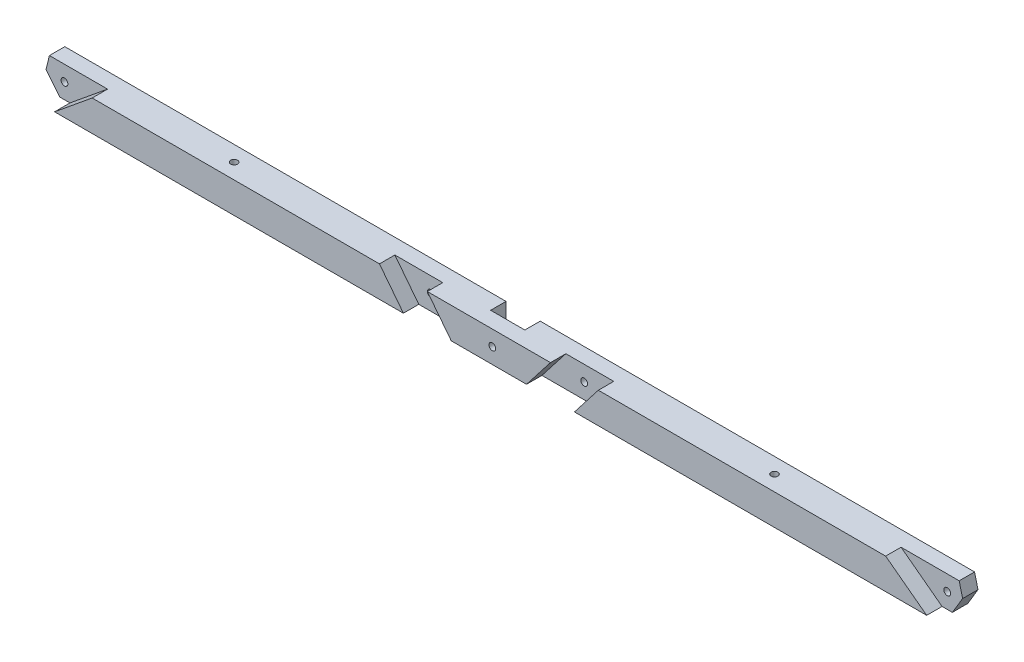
from build123d import *

# Parameters (mm, degrees)
ESQUISSE1_W              = 268
ESQUISSE1_H              = 9
EXTRUSION1_DEPTH         = 9
ESQUISSE2_W              = 10
ESQUISSE2_H              = 9
ENL_V_MAT_EXTRU_1_DEPTH  = 4.5
ESQUISSE3_R              = 1
ENL_V_MAT_EXTRU_2_DEPTH  = 4.5
ENL_V_MAT_EXTRU_3_DEPTH  = 4.5
ESQUISSE5_R              = 1
ENL_V_MAT_EXTRU_4_DEPTH  = 4.5
ENL_V_MAT_EXTRU_5_DEPTH  = 4.5
ESQUISSE7_R              = 1
ENL_V_MAT_EXTRU_6_DEPTH  = 4.5
ENL_V_MAT_EXTRU_8_DEPTH  = 9
ENL_V_MAT_EXTRU_9_DEPTH  = 9
ENL_V_MAT_EXTRU_10_DEPTH = 4.5
ESQUISSE11_R             = 1
ENL_V_MAT_EXTRU_11_DEPTH = 4.5
ENL_V_MAT_EXTRU_14_DEPTH = 9
ENL_V_MAT_EXTRU_15_DEPTH = 9
ENL_V_MAT_EXTRU_16_DEPTH = 4.5
ESQUISSE15_R             = 1
ENL_V_MAT_EXTRU_17_DEPTH = 4.5
ESQUISSE16_W             = 10
ESQUISSE16_H             = 9
EXTRUSION2_DEPTH         = 4.5
ESQUISSE17_W             = 10
ESQUISSE17_H             = 9
ENL_V_MAT_EXTRU_20_DEPTH = 4.5
ESQUISSE19_R             = 1
ENL_V_MAT_EXTRU_21_DEPTH = 4.5
ESQUISSE20_R             = 1
ENL_V_MAT_EXTRU_22_DEPTH = 9
ESQUISSE21_R             = 1
ENL_V_MAT_EXTRU_23_DEPTH = 9


with BuildPart() as part:
    # Esquisse1 → Extrusion1 (new body)
    with BuildSketch(Plane.XY):
        with Locations((134, 4.5)):
            Rectangle(ESQUISSE1_W, ESQUISSE1_H)
    extrude(amount=EXTRUSION1_DEPTH)

    # Esquisse2 → Enl_v. mat.-Extru.1 (cut)
    with BuildSketch(Plane.XY.offset(9)):
        with Locations((134, 4.5)):
            Rectangle(ESQUISSE2_W, ESQUISSE2_H)
    extrude(amount=-ENL_V_MAT_EXTRU_1_DEPTH, mode=Mode.SUBTRACT)

    # Esquisse3 → Enl_v. mat.-Extru.2 (cut)
    with BuildSketch(Plane.XY.offset(4.5)):
        with Locations((134, 4.5)):
            Circle(ESQUISSE3_R)
    extrude(amount=-ENL_V_MAT_EXTRU_2_DEPTH, mode=Mode.SUBTRACT)

    # Esquisse4 → Enl_v. mat.-Extru.3 (cut)
    with BuildSketch(Plane.XY.offset(9)):
        Polygon((152, 9), (166, 9), (159, 0), (145, 0), align=None)
    extrude(amount=-ENL_V_MAT_EXTRU_3_DEPTH, mode=Mode.SUBTRACT)

    # Esquisse5 → Enl_v. mat.-Extru.4 (cut)
    with BuildSketch(Plane.XY.offset(4.5)):
        with Locations((157.368031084, 4.5)):
            Circle(ESQUISSE5_R)
    extrude(amount=-ENL_V_MAT_EXTRU_4_DEPTH, mode=Mode.SUBTRACT)

    # Esquisse6 → Enl_v. mat.-Extru.5 (cut)
    with BuildSketch(Plane.XY.offset(9)):
        Polygon((116, 9), (102, 9), (109, 0), (123, 0), align=None)
    extrude(amount=-ENL_V_MAT_EXTRU_5_DEPTH, mode=Mode.SUBTRACT)

    # Esquisse7 → Enl_v. mat.-Extru.6 (cut)
    with BuildSketch(Plane.XY.offset(4.5)):
        with Locations((112.5, 4.5)):
            Circle(ESQUISSE7_R)
    extrude(amount=-ENL_V_MAT_EXTRU_6_DEPTH, mode=Mode.SUBTRACT)

    # Esquisse8 → Enl_v. mat.-Extru.8 (cut)
    with BuildSketch(Plane.XY.offset(9)):
        Polygon((0, 0), (4, 0), (0, 5), align=None)
    extrude(amount=-ENL_V_MAT_EXTRU_8_DEPTH, mode=Mode.SUBTRACT)

    # Esquisse9 → Enl_v. mat.-Extru.9 (cut)
    with BuildSketch(Plane.XY.offset(9)):
        Polygon((1, 9), (0, 9), (0, 5), align=None)
    extrude(amount=-ENL_V_MAT_EXTRU_9_DEPTH, mode=Mode.SUBTRACT)

    # Esquisse10 → Enl_v. mat.-Extru.10 (cut)
    with BuildSketch(Plane.XY.offset(9)):
        Polygon((1, 9), (18, 9), (7, 0), (4, 0), (0, 5), align=None)
    extrude(amount=-ENL_V_MAT_EXTRU_10_DEPTH, mode=Mode.SUBTRACT)

    # Esquisse11 → Enl_v. mat.-Extru.11 (cut)
    with BuildSketch(Plane.XY.offset(4.5)):
        with Locations((5.393664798, 4.5)):
            Circle(ESQUISSE11_R)
    extrude(amount=-ENL_V_MAT_EXTRU_11_DEPTH, mode=Mode.SUBTRACT)

    # Esquisse12 → Enl_v. mat.-Extru.14 (cut)
    with BuildSketch(Plane.XY.offset(9)):
        Polygon((268, 0), (268, 5), (265, 0), align=None)
    extrude(amount=-ENL_V_MAT_EXTRU_14_DEPTH, mode=Mode.SUBTRACT)

    # Esquisse13 → Enl_v. mat.-Extru.15 (cut)
    with BuildSketch(Plane.XY.offset(9)):
        Polygon((268, 5), (267, 9), (268, 9), align=None)
    extrude(amount=-ENL_V_MAT_EXTRU_15_DEPTH, mode=Mode.SUBTRACT)

    # Esquisse14 → Enl_v. mat.-Extru.16 (cut)
    with BuildSketch(Plane.XY.offset(9)):
        Polygon((265, 0), (268, 5), (267, 9), (250, 9), (262, 0), align=None)
    extrude(amount=-ENL_V_MAT_EXTRU_16_DEPTH, mode=Mode.SUBTRACT)

    # Esquisse15 → Enl_v. mat.-Extru.17 (cut)
    with BuildSketch(Plane.XY.offset(4.5)):
        with Locations((263.5, 4.5)):
            Circle(ESQUISSE15_R)
    extrude(amount=-ENL_V_MAT_EXTRU_17_DEPTH, mode=Mode.SUBTRACT)

    # Esquisse16 → Extrusion2 (add)
    with BuildSketch(Plane.XY.offset(4.5)):
        with Locations((134, 4.5)):
            Rectangle(ESQUISSE16_W, ESQUISSE16_H)
    extrude(amount=EXTRUSION2_DEPTH)

    # Esquisse17 → Enl_v. mat.-Extru.20 (cut)
    with BuildSketch(Plane(origin=(0, 0, 0), x_dir=(-1, 0, 0), z_dir=(0, 0, -1))):
        with Locations((-135, 4.5)):
            Rectangle(ESQUISSE17_W, ESQUISSE17_H)
    extrude(amount=-ENL_V_MAT_EXTRU_20_DEPTH, mode=Mode.SUBTRACT)

    # Esquisse19 → Enl_v. mat.-Extru.21 (cut)
    with BuildSketch(Plane(origin=(0, 0, 4.5), x_dir=(-1, 0, 0), z_dir=(0, 0, -1))):
        with Locations((-135, 4.5)):
            Circle(ESQUISSE19_R)
    extrude(amount=-ENL_V_MAT_EXTRU_21_DEPTH, mode=Mode.SUBTRACT)

    # Esquisse20 → Enl_v. mat.-Extru.22 (cut)
    with BuildSketch(Plane(origin=(0, 9, 0), x_dir=(1, 0, 0), z_dir=(0, 1, 0))):
        with Locations(Location((55, -4.5, 0), (0, 0, 270))):
            Circle(ESQUISSE20_R)
    extrude(amount=-ENL_V_MAT_EXTRU_22_DEPTH, mode=Mode.SUBTRACT)

    # Esquisse21 → Enl_v. mat.-Extru.23 (cut)
    with BuildSketch(Plane(origin=(0, 9, 0), x_dir=(1, 0, 0), z_dir=(0, 1, 0))):
        with Locations(Location((213, -4.5, 0), (0, 0, 270))):
            Circle(ESQUISSE21_R)
    extrude(amount=-ENL_V_MAT_EXTRU_23_DEPTH, mode=Mode.SUBTRACT)


solid = part.part
